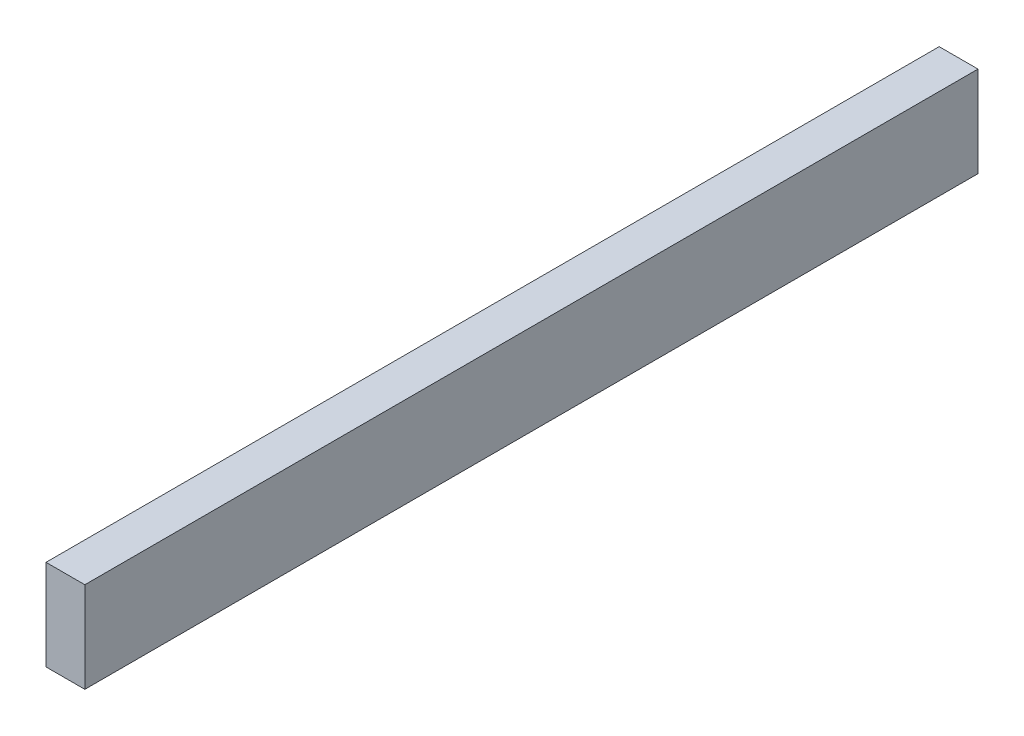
from build123d import *

# Parameters (mm, degrees)
SKETCH1_W           = 38.1
SKETCH1_H           = 88.9
BOSS_EXTRUDE1_DEPTH = 876.3


with BuildPart() as part:
    # Sketch1 → Boss-Extrude1 (new body)
    with BuildSketch(Plane.XY):
        Rectangle(SKETCH1_W, SKETCH1_H)
    extrude(amount=BOSS_EXTRUDE1_DEPTH)


solid = part.part
